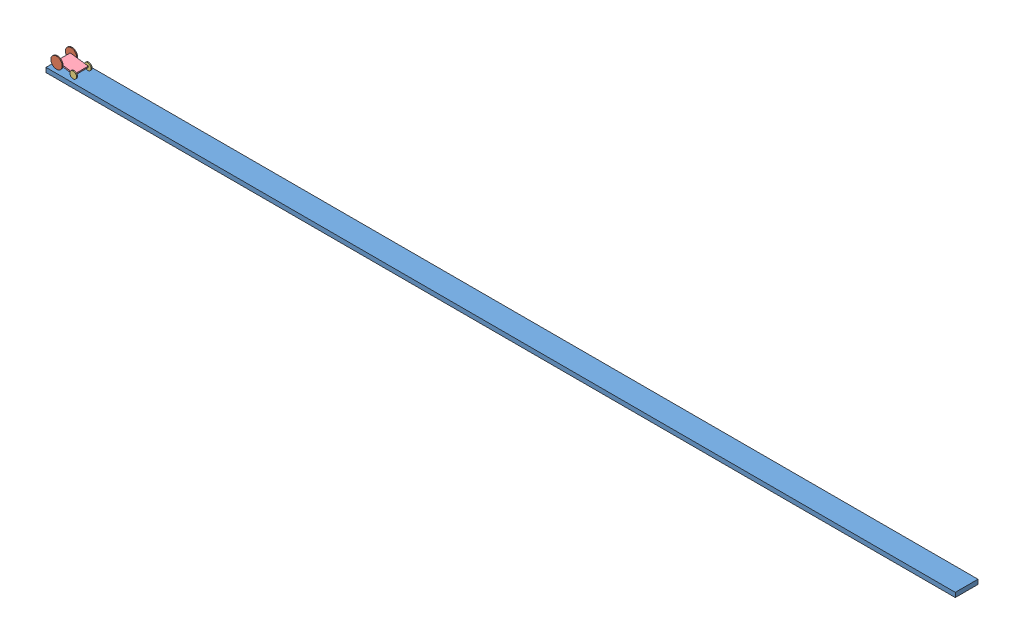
SolidWorks assembly simu sur plat.SLDASM, configuration Défaut (file format 9000). Lengths in mm.
Overall size (20000 350 500).
4 component instances, 4 part files, 7 mates.
Components (placement in the parent):
- sol plat-1: sol plat.SLDPRT [Défaut] at (-1530.9004 -444.5749 0) size (20000 100 500)
- Roue arriere-1: Roue arriere.SLDPRT [Défaut] at (-1379.5288 -219.5749 -170) size (250 250 340)
- Roue avant-1: Roue avant.SLDPRT [Défaut] at (-1012.9228 -269.5749 -170) size (150 150 340)
- chassis-1: chassis.SLDPRT [Défaut] at (-1401.3724 -231.7346 0) x (0.990827 -0.135135 0) z (0 0 1) size (400 30 300)
Mates (geometry in assembly coordinates):
- Coaxiale2: concentric aligned: cylinder of Roue arriere-1 through (-1379.5288 -219.5749 150) axis (0 0 -1) radius 5; cylinder of chassis-1 through (-1379.5288 -219.5749 150) axis (0 0 -1) radius 5
- Coïncidente1: coincident anti-aligned: plane of Roue arriere-1 through (-1379.5288 -219.5749 150) normal (0 0 -1); plane of chassis-1 through (-1397.3183 -202.0098 150) normal (0 0 1)
- Coaxiale3: concentric aligned: cylinder of Roue avant-1 through (-1012.9228 -269.5749 150) axis (0 0 -1) radius 5; cylinder of chassis-1 through (-1012.9228 -269.5749 150) axis (0 0 -1) radius 5
- Coïncidente2: coincident anti-aligned: plane of Roue avant-1 through (-1012.9228 -269.5749 150) normal (0 0 -1); plane of chassis-1 through (-1397.3183 -202.0098 150) normal (0 0 1)
- Tangent1: tangent anti-aligned: plane of sol plat-1 through (-1530.9004 -344.5749 250) normal (0 1 0); cylinder of Roue arriere-1 through (-1379.5288 -219.5749 170) axis (0 0 -1) radius 125
- Tangent2: tangent anti-aligned: plane of sol plat-1 through (-1530.9004 -344.5749 250) normal (0 1 0); cylinder of Roue avant-1 through (-1012.9228 -269.5749 170) axis (0 0 -1) radius 75
- Distance1: distance = 80 mm aligned: plane of Roue arriere-1 through (-1379.5288 -219.5749 170) normal (0 0 1); plane of sol plat-1 through (-1530.9004 -344.5749 250) normal (0 0 1)
